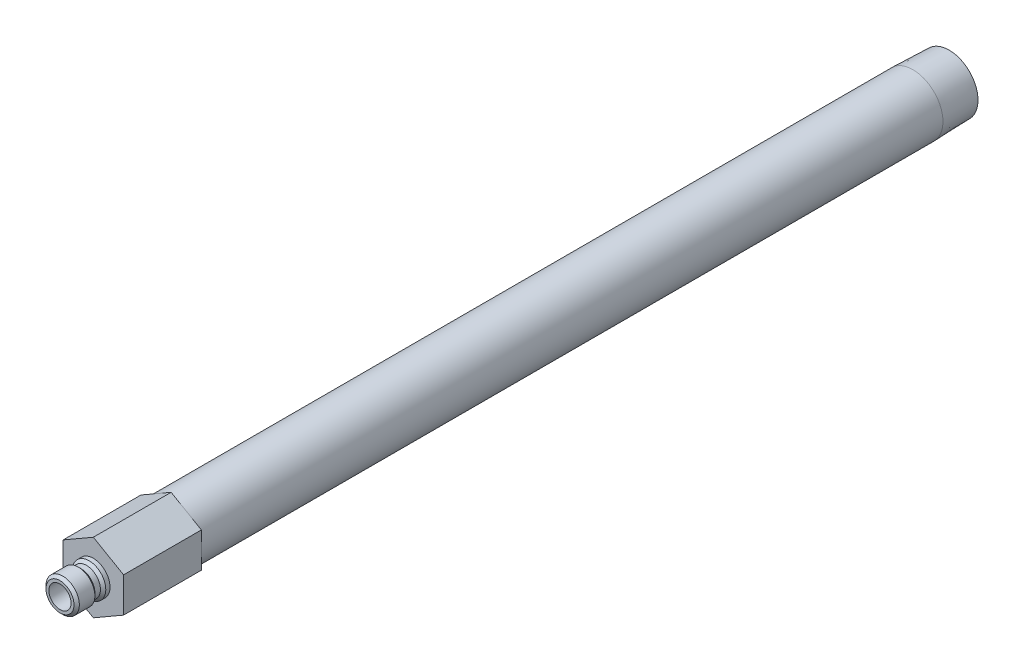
ISO-10303-21;
HEADER;
FILE_DESCRIPTION(('STEP AP214'),'2;1');
FILE_NAME('part.step','',(''),(''),'','','');
FILE_SCHEMA(('AUTOMOTIVE_DESIGN { 1 0 10303 214 1 1 1 1 }'));
ENDSEC;
DATA;
#1=APPLICATION_CONTEXT('core data for automotive mechanical design processes');
#2=APPLICATION_PROTOCOL_DEFINITION('international standard','automotive_design',2000,#1);
#3=PRODUCT_CONTEXT('',#1,'mechanical');
#4=PRODUCT('Part','Part','',(#3));
#5=PRODUCT_RELATED_PRODUCT_CATEGORY('part','',(#4));
#6=PRODUCT_DEFINITION_FORMATION('','',#4);
#7=PRODUCT_DEFINITION_CONTEXT('part definition',#1,'design');
#8=PRODUCT_DEFINITION('design','',#6,#7);
#9=PRODUCT_DEFINITION_SHAPE('','',#8);
#10=(LENGTH_UNIT() NAMED_UNIT(*) SI_UNIT(.MILLI.,.METRE.));
#11=(NAMED_UNIT(*) PLANE_ANGLE_UNIT() SI_UNIT($,.RADIAN.));
#12=(NAMED_UNIT(*) SI_UNIT($,.STERADIAN.) SOLID_ANGLE_UNIT());
#13=UNCERTAINTY_MEASURE_WITH_UNIT(LENGTH_MEASURE(1.E-05),#10,'distance_accuracy_value','');
#14=(GEOMETRIC_REPRESENTATION_CONTEXT(3) GLOBAL_UNCERTAINTY_ASSIGNED_CONTEXT((#13)) GLOBAL_UNIT_ASSIGNED_CONTEXT((#10,
#11,#12)) REPRESENTATION_CONTEXT('',''));
#15=CARTESIAN_POINT('',(0.,0.,0.));
#16=DIRECTION('',(0.,0.,1.));
#17=DIRECTION('',(1.,0.,0.));
#18=AXIS2_PLACEMENT_3D('',#15,#16,#17);
#19=CARTESIAN_POINT('',(0.,0.,0.));
#20=DIRECTION('',(0.,0.,-1.));
#21=DIRECTION('',(0.,1.,0.));
#22=AXIS2_PLACEMENT_3D('',#19,#20,#21);
#23=CYLINDRICAL_SURFACE('',#22,8.57249999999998);
#24=CARTESIAN_POINT('',(0.,0.,-234.1372));
#25=DIRECTION('',(0.,0.,-1.));
#26=DIRECTION('',(0.,1.,0.));
#27=AXIS2_PLACEMENT_3D('',#24,#25,#26);
#28=CIRCLE('',#27,8.57249999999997);
#29=CARTESIAN_POINT('',(0.,8.5725,-234.1372));
#30=VERTEX_POINT('',#29);
#31=EDGE_CURVE('E168',#30,#30,#28,.T.);
#32=ORIENTED_EDGE('',*,*,#31,.F.);
#33=EDGE_LOOP('',(#32));
#34=FACE_BOUND('',#33,.T.);
#35=CARTESIAN_POINT('',(0.,0.,-22.225));
#36=DIRECTION('',(0.,0.,1.));
#37=DIRECTION('',(1.,0.,0.));
#38=AXIS2_PLACEMENT_3D('',#35,#36,#37);
#39=CIRCLE('',#38,8.57249999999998);
#40=CARTESIAN_POINT('',(8.57249999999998,0.,-22.225));
#41=VERTEX_POINT('',#40);
#42=EDGE_CURVE('E37',#41,#41,#39,.F.);
#43=ORIENTED_EDGE('',*,*,#42,.T.);
#44=EDGE_LOOP('',(#43));
#45=FACE_BOUND('',#44,.T.);
#46=ADVANCED_FACE('F33',(#34,#45),#23,.T.);
#47=CARTESIAN_POINT('',(0.,0.,0.));
#48=DIRECTION('',(0.,0.,-1.));
#49=DIRECTION('',(0.,1.,0.));
#50=AXIS2_PLACEMENT_3D('',#47,#48,#49);
#51=CYLINDRICAL_SURFACE('',#50,3.175);
#52=CARTESIAN_POINT('',(0.,0.,9.525));
#53=DIRECTION('',(0.,0.,-1.));
#54=DIRECTION('',(0.,1.,0.));
#55=AXIS2_PLACEMENT_3D('',#52,#53,#54);
#56=CIRCLE('',#55,3.175);
#57=CARTESIAN_POINT('',(0.,3.175,9.525));
#58=VERTEX_POINT('',#57);
#59=EDGE_CURVE('E144',#58,#58,#56,.T.);
#60=ORIENTED_EDGE('',*,*,#59,.F.);
#61=EDGE_LOOP('',(#60));
#62=FACE_BOUND('',#61,.T.);
#63=CARTESIAN_POINT('',(0.,0.,-22.225));
#64=DIRECTION('',(0.,0.,-1.));
#65=DIRECTION('',(0.,1.,0.));
#66=AXIS2_PLACEMENT_3D('',#63,#64,#65);
#67=CIRCLE('',#66,3.17499999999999);
#68=CARTESIAN_POINT('',(0.,3.175,-22.225));
#69=VERTEX_POINT('',#68);
#70=EDGE_CURVE('E11',#69,#69,#67,.T.);
#71=ORIENTED_EDGE('',*,*,#70,.T.);
#72=EDGE_LOOP('',(#71));
#73=FACE_BOUND('',#72,.T.);
#74=ADVANCED_FACE('F35',(#62,#73),#51,.F.);
#75=CARTESIAN_POINT('',(0.,3.175,-22.225));
#76=DIRECTION('',(0.,0.,-1.));
#77=DIRECTION('',(0.,1.,0.));
#78=AXIS2_PLACEMENT_3D('',#75,#76,#77);
#79=PLANE('',#78);
#80=CARTESIAN_POINT('',(0.,0.,-22.225));
#81=DIRECTION('',(0.,0.,-1.));
#82=DIRECTION('',(0.,1.,0.));
#83=AXIS2_PLACEMENT_3D('',#80,#81,#82);
#84=CIRCLE('',#83,6.2611);
#85=CARTESIAN_POINT('',(0.,6.2611,-22.225));
#86=VERTEX_POINT('',#85);
#87=EDGE_CURVE('E43',#86,#86,#84,.T.);
#88=ORIENTED_EDGE('',*,*,#87,.T.);
#89=EDGE_LOOP('',(#88));
#90=FACE_BOUND('',#89,.T.);
#91=ORIENTED_EDGE('',*,*,#70,.F.);
#92=EDGE_LOOP('',(#91));
#93=FACE_BOUND('',#92,.T.);
#94=ADVANCED_FACE('F180',(#90,#93),#79,.T.);
#95=CARTESIAN_POINT('',(0.,0.,0.));
#96=DIRECTION('',(0.,0.,-1.));
#97=DIRECTION('',(0.,1.,0.));
#98=AXIS2_PLACEMENT_3D('',#95,#96,#97);
#99=CYLINDRICAL_SURFACE('',#98,6.26109999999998);
#100=CARTESIAN_POINT('',(0.,0.,-244.475));
#101=DIRECTION('',(0.,0.,-1.));
#102=DIRECTION('',(0.,1.,0.));
#103=AXIS2_PLACEMENT_3D('',#100,#101,#102);
#104=CIRCLE('',#103,6.26109999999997);
#105=CARTESIAN_POINT('',(0.,6.2611,-244.475));
#106=VERTEX_POINT('',#105);
#107=EDGE_CURVE('E174',#106,#106,#104,.T.);
#108=ORIENTED_EDGE('',*,*,#107,.T.);
#109=EDGE_LOOP('',(#108));
#110=FACE_BOUND('',#109,.T.);
#111=ORIENTED_EDGE('',*,*,#87,.F.);
#112=EDGE_LOOP('',(#111));
#113=FACE_BOUND('',#112,.T.);
#114=ADVANCED_FACE('F183',(#110,#113),#99,.F.);
#115=CARTESIAN_POINT('',(0.,8.24944566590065,-244.475));
#116=DIRECTION('',(0.,0.,-1.));
#117=DIRECTION('',(0.,1.,0.));
#118=AXIS2_PLACEMENT_3D('',#115,#116,#117);
#119=PLANE('',#118);
#120=CARTESIAN_POINT('',(0.,0.,-244.475));
#121=DIRECTION('',(0.,0.,-1.));
#122=DIRECTION('',(0.,1.,0.));
#123=AXIS2_PLACEMENT_3D('',#120,#121,#122);
#124=CIRCLE('',#123,8.24944566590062);
#125=CARTESIAN_POINT('',(0.,8.24944566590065,-244.475));
#126=VERTEX_POINT('',#125);
#127=EDGE_CURVE('E171',#126,#126,#124,.T.);
#128=ORIENTED_EDGE('',*,*,#127,.T.);
#129=EDGE_LOOP('',(#128));
#130=FACE_BOUND('',#129,.T.);
#131=ORIENTED_EDGE('',*,*,#107,.F.);
#132=EDGE_LOOP('',(#131));
#133=FACE_BOUND('',#132,.T.);
#134=ADVANCED_FACE('F185',(#130,#133),#119,.T.);
#135=CARTESIAN_POINT('',(0.,0.,-244.475));
#136=DIRECTION('',(0.,0.,1.));
#137=DIRECTION('',(0.,-1.,0.));
#138=AXIS2_PLACEMENT_3D('',#135,#136,#137);
#139=CONICAL_SURFACE('',#138,8.24944566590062,0.0312396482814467);
#140=ORIENTED_EDGE('',*,*,#31,.T.);
#141=EDGE_LOOP('',(#140));
#142=FACE_BOUND('',#141,.T.);
#143=ORIENTED_EDGE('',*,*,#127,.F.);
#144=EDGE_LOOP('',(#143));
#145=FACE_BOUND('',#144,.T.);
#146=ADVANCED_FACE('F192',(#142,#145),#139,.T.);
#147=CARTESIAN_POINT('',(0.,4.7625,0.));
#148=DIRECTION('',(0.,0.,1.));
#149=DIRECTION('',(0.,-1.,0.));
#150=AXIS2_PLACEMENT_3D('',#147,#148,#149);
#151=PLANE('',#150);
#152=CARTESIAN_POINT('',(0.,0.,0.));
#153=DIRECTION('',(0.,0.,-1.));
#154=DIRECTION('',(0.,1.,0.));
#155=AXIS2_PLACEMENT_3D('',#152,#153,#154);
#156=CIRCLE('',#155,4.7625);
#157=CARTESIAN_POINT('',(0.,4.7625,0.));
#158=VERTEX_POINT('',#157);
#159=EDGE_CURVE('E165',#158,#158,#156,.T.);
#160=ORIENTED_EDGE('',*,*,#159,.T.);
#161=EDGE_LOOP('',(#160));
#162=FACE_BOUND('',#161,.T.);
#163=DIRECTION('',(-0.866025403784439,-0.5,0.));
#164=VECTOR('',#163,1.);
#165=CARTESIAN_POINT('',(0.,9.97199384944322,0.));
#166=LINE('',#165,#164);
#167=CARTESIAN_POINT('',(0.,9.97199384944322,0.));
#168=VERTEX_POINT('',#167);
#169=CARTESIAN_POINT('',(-8.636,4.98599692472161,0.));
#170=VERTEX_POINT('',#169);
#171=EDGE_CURVE('E122',#168,#170,#166,.T.);
#172=ORIENTED_EDGE('',*,*,#171,.T.);
#173=DIRECTION('',(0.,-1.,0.));
#174=VECTOR('',#173,1.);
#175=CARTESIAN_POINT('',(-8.636,4.98599692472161,0.));
#176=LINE('',#175,#174);
#177=CARTESIAN_POINT('',(-8.636,-4.98599692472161,0.));
#178=VERTEX_POINT('',#177);
#179=EDGE_CURVE('E125',#170,#178,#176,.T.);
#180=ORIENTED_EDGE('',*,*,#179,.T.);
#181=DIRECTION('',(0.866025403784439,-0.5,0.));
#182=VECTOR('',#181,1.);
#183=CARTESIAN_POINT('',(-8.636,-4.98599692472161,0.));
#184=LINE('',#183,#182);
#185=CARTESIAN_POINT('',(0.,-9.97199384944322,0.));
#186=VERTEX_POINT('',#185);
#187=EDGE_CURVE('E128',#178,#186,#184,.T.);
#188=ORIENTED_EDGE('',*,*,#187,.T.);
#189=DIRECTION('',(0.866025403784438,0.5,0.));
#190=VECTOR('',#189,1.);
#191=CARTESIAN_POINT('',(0.,-9.97199384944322,0.));
#192=LINE('',#191,#190);
#193=CARTESIAN_POINT('',(8.636,-4.98599692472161,0.));
#194=VERTEX_POINT('',#193);
#195=EDGE_CURVE('E131',#186,#194,#192,.T.);
#196=ORIENTED_EDGE('',*,*,#195,.T.);
#197=DIRECTION('',(0.,1.,0.));
#198=VECTOR('',#197,1.);
#199=CARTESIAN_POINT('',(8.636,-4.98599692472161,0.));
#200=LINE('',#199,#198);
#201=CARTESIAN_POINT('',(8.636,4.98599692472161,0.));
#202=VERTEX_POINT('',#201);
#203=EDGE_CURVE('E99',#194,#202,#200,.T.);
#204=ORIENTED_EDGE('',*,*,#203,.T.);
#205=DIRECTION('',(-0.866025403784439,0.5,0.));
#206=VECTOR('',#205,1.);
#207=CARTESIAN_POINT('',(8.636,4.98599692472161,0.));
#208=LINE('',#207,#206);
#209=EDGE_CURVE('E134',#202,#168,#208,.T.);
#210=ORIENTED_EDGE('',*,*,#209,.T.);
#211=EDGE_LOOP('',(#172,#180,#188,#196,#204,#210));
#212=FACE_BOUND('',#211,.T.);
#213=ADVANCED_FACE('F206',(#162,#212),#151,.T.);
#214=CARTESIAN_POINT('',(0.,0.,0.));
#215=DIRECTION('',(0.,0.,-1.));
#216=DIRECTION('',(0.,1.,0.));
#217=AXIS2_PLACEMENT_3D('',#214,#215,#216);
#218=CYLINDRICAL_SURFACE('',#217,4.7625);
#219=CARTESIAN_POINT('',(0.,0.,1.2065));
#220=DIRECTION('',(0.,0.,-1.));
#221=DIRECTION('',(0.,1.,0.));
#222=AXIS2_PLACEMENT_3D('',#219,#220,#221);
#223=CIRCLE('',#222,4.7625);
#224=CARTESIAN_POINT('',(0.,4.7625,1.2065));
#225=VERTEX_POINT('',#224);
#226=EDGE_CURVE('E162',#225,#225,#223,.T.);
#227=ORIENTED_EDGE('',*,*,#226,.T.);
#228=EDGE_LOOP('',(#227));
#229=FACE_BOUND('',#228,.T.);
#230=ORIENTED_EDGE('',*,*,#159,.F.);
#231=EDGE_LOOP('',(#230));
#232=FACE_BOUND('',#231,.T.);
#233=ADVANCED_FACE('F213',(#229,#232),#218,.T.);
#234=CARTESIAN_POINT('',(0.,0.,1.2065));
#235=DIRECTION('',(0.,0.,-1.));
#236=DIRECTION('',(0.,1.,0.));
#237=AXIS2_PLACEMENT_3D('',#234,#235,#236);
#238=CONICAL_SURFACE('',#237,4.7625,0.785398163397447);
#239=CARTESIAN_POINT('',(0.,0.,1.9685));
#240=DIRECTION('',(0.,0.,-1.));
#241=DIRECTION('',(0.,1.,0.));
#242=AXIS2_PLACEMENT_3D('',#239,#240,#241);
#243=CIRCLE('',#242,4.0005);
#244=CARTESIAN_POINT('',(0.,4.0005,1.9685));
#245=VERTEX_POINT('',#244);
#246=EDGE_CURVE('E159',#245,#245,#243,.T.);
#247=ORIENTED_EDGE('',*,*,#246,.T.);
#248=EDGE_LOOP('',(#247));
#249=FACE_BOUND('',#248,.T.);
#250=ORIENTED_EDGE('',*,*,#226,.F.);
#251=EDGE_LOOP('',(#250));
#252=FACE_BOUND('',#251,.T.);
#253=ADVANCED_FACE('F222',(#249,#252),#238,.T.);
#254=CARTESIAN_POINT('',(0.,0.,0.));
#255=DIRECTION('',(0.,0.,-1.));
#256=DIRECTION('',(0.,1.,0.));
#257=AXIS2_PLACEMENT_3D('',#254,#255,#256);
#258=CYLINDRICAL_SURFACE('',#257,4.0005);
#259=CARTESIAN_POINT('',(0.,0.,3.556));
#260=DIRECTION('',(0.,0.,-1.));
#261=DIRECTION('',(0.,1.,0.));
#262=AXIS2_PLACEMENT_3D('',#259,#260,#261);
#263=CIRCLE('',#262,4.0005);
#264=CARTESIAN_POINT('',(0.,4.0005,3.556));
#265=VERTEX_POINT('',#264);
#266=EDGE_CURVE('E156',#265,#265,#263,.T.);
#267=ORIENTED_EDGE('',*,*,#266,.T.);
#268=EDGE_LOOP('',(#267));
#269=FACE_BOUND('',#268,.T.);
#270=ORIENTED_EDGE('',*,*,#246,.F.);
#271=EDGE_LOOP('',(#270));
#272=FACE_BOUND('',#271,.T.);
#273=ADVANCED_FACE('F263',(#269,#272),#258,.T.);
#274=CARTESIAN_POINT('',(0.,0.,3.556));
#275=DIRECTION('',(0.,0.,1.));
#276=DIRECTION('',(0.,-1.,0.));
#277=AXIS2_PLACEMENT_3D('',#274,#275,#276);
#278=CONICAL_SURFACE('',#277,4.0005,0.785398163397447);
#279=CARTESIAN_POINT('',(0.,0.,4.318));
#280=DIRECTION('',(0.,0.,-1.));
#281=DIRECTION('',(0.,1.,0.));
#282=AXIS2_PLACEMENT_3D('',#279,#280,#281);
#283=CIRCLE('',#282,4.7625);
#284=CARTESIAN_POINT('',(0.,4.7625,4.318));
#285=VERTEX_POINT('',#284);
#286=EDGE_CURVE('E153',#285,#285,#283,.T.);
#287=ORIENTED_EDGE('',*,*,#286,.T.);
#288=EDGE_LOOP('',(#287));
#289=FACE_BOUND('',#288,.T.);
#290=ORIENTED_EDGE('',*,*,#266,.F.);
#291=EDGE_LOOP('',(#290));
#292=FACE_BOUND('',#291,.T.);
#293=ADVANCED_FACE('F259',(#289,#292),#278,.T.);
#294=CARTESIAN_POINT('',(0.,0.,0.));
#295=DIRECTION('',(0.,0.,-1.));
#296=DIRECTION('',(0.,1.,0.));
#297=AXIS2_PLACEMENT_3D('',#294,#295,#296);
#298=CYLINDRICAL_SURFACE('',#297,4.7625);
#299=CARTESIAN_POINT('',(0.,0.,8.763));
#300=DIRECTION('',(0.,0.,-1.));
#301=DIRECTION('',(0.,1.,0.));
#302=AXIS2_PLACEMENT_3D('',#299,#300,#301);
#303=CIRCLE('',#302,4.7625);
#304=CARTESIAN_POINT('',(0.,4.7625,8.763));
#305=VERTEX_POINT('',#304);
#306=EDGE_CURVE('E150',#305,#305,#303,.T.);
#307=ORIENTED_EDGE('',*,*,#306,.T.);
#308=EDGE_LOOP('',(#307));
#309=FACE_BOUND('',#308,.T.);
#310=ORIENTED_EDGE('',*,*,#286,.F.);
#311=EDGE_LOOP('',(#310));
#312=FACE_BOUND('',#311,.T.);
#313=ADVANCED_FACE('F255',(#309,#312),#298,.T.);
#314=CARTESIAN_POINT('',(0.,0.,8.763));
#315=DIRECTION('',(0.,0.,-1.));
#316=DIRECTION('',(0.,1.,0.));
#317=AXIS2_PLACEMENT_3D('',#314,#315,#316);
#318=CONICAL_SURFACE('',#317,4.7625,0.785398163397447);
#319=CARTESIAN_POINT('',(0.,0.,9.525));
#320=DIRECTION('',(0.,0.,-1.));
#321=DIRECTION('',(0.,1.,0.));
#322=AXIS2_PLACEMENT_3D('',#319,#320,#321);
#323=CIRCLE('',#322,4.0005);
#324=CARTESIAN_POINT('',(0.,4.0005,9.525));
#325=VERTEX_POINT('',#324);
#326=EDGE_CURVE('E147',#325,#325,#323,.T.);
#327=ORIENTED_EDGE('',*,*,#326,.T.);
#328=EDGE_LOOP('',(#327));
#329=FACE_BOUND('',#328,.T.);
#330=ORIENTED_EDGE('',*,*,#306,.F.);
#331=EDGE_LOOP('',(#330));
#332=FACE_BOUND('',#331,.T.);
#333=ADVANCED_FACE('F251',(#329,#332),#318,.T.);
#334=CARTESIAN_POINT('',(0.,3.175,9.525));
#335=DIRECTION('',(0.,0.,1.));
#336=DIRECTION('',(0.,-1.,0.));
#337=AXIS2_PLACEMENT_3D('',#334,#335,#336);
#338=PLANE('',#337);
#339=ORIENTED_EDGE('',*,*,#59,.T.);
#340=EDGE_LOOP('',(#339));
#341=FACE_BOUND('',#340,.T.);
#342=ORIENTED_EDGE('',*,*,#326,.F.);
#343=EDGE_LOOP('',(#342));
#344=FACE_BOUND('',#343,.T.);
#345=ADVANCED_FACE('F239',(#341,#344),#338,.T.);
#346=CARTESIAN_POINT('',(0.,9.97199384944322,-22.225));
#347=DIRECTION('',(-0.5,0.866025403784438,0.));
#348=DIRECTION('',(-0.866025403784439,-0.5,0.));
#349=AXIS2_PLACEMENT_3D('',#346,#347,#348);
#350=PLANE('',#349);
#351=ORIENTED_EDGE('',*,*,#171,.F.);
#352=DIRECTION('',(0.,0.,1.));
#353=VECTOR('',#352,1.);
#354=CARTESIAN_POINT('',(0.,9.97199384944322,-22.225));
#355=LINE('',#354,#353);
#356=CARTESIAN_POINT('',(0.,9.97199384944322,-22.225));
#357=VERTEX_POINT('',#356);
#358=EDGE_CURVE('E51',#357,#168,#355,.T.);
#359=ORIENTED_EDGE('',*,*,#358,.F.);
#360=DIRECTION('',(-0.866025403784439,-0.5,0.));
#361=VECTOR('',#360,1.);
#362=CARTESIAN_POINT('',(0.,9.97199384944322,-22.225));
#363=LINE('',#362,#361);
#364=CARTESIAN_POINT('',(-8.636,4.98599692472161,-22.225));
#365=VERTEX_POINT('',#364);
#366=EDGE_CURVE('E137',#357,#365,#363,.T.);
#367=ORIENTED_EDGE('',*,*,#366,.T.);
#368=DIRECTION('',(0.,0.,1.));
#369=VECTOR('',#368,1.);
#370=CARTESIAN_POINT('',(-8.636,4.98599692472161,-22.225));
#371=LINE('',#370,#369);
#372=EDGE_CURVE('E86',#365,#170,#371,.T.);
#373=ORIENTED_EDGE('',*,*,#372,.T.);
#374=EDGE_LOOP('',(#351,#359,#367,#373));
#375=FACE_BOUND('',#374,.T.);
#376=ADVANCED_FACE('F226',(#375),#350,.T.);
#377=CARTESIAN_POINT('',(8.636,4.98599692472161,-22.225));
#378=DIRECTION('',(0.5,0.866025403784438,0.));
#379=DIRECTION('',(-0.866025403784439,0.5,0.));
#380=AXIS2_PLACEMENT_3D('',#377,#378,#379);
#381=PLANE('',#380);
#382=ORIENTED_EDGE('',*,*,#209,.F.);
#383=DIRECTION('',(0.,0.,1.));
#384=VECTOR('',#383,1.);
#385=CARTESIAN_POINT('',(8.636,4.98599692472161,-22.225));
#386=LINE('',#385,#384);
#387=CARTESIAN_POINT('',(8.636,4.98599692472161,-22.225));
#388=VERTEX_POINT('',#387);
#389=EDGE_CURVE('E74',#388,#202,#386,.T.);
#390=ORIENTED_EDGE('',*,*,#389,.F.);
#391=DIRECTION('',(-0.866025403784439,0.5,0.));
#392=VECTOR('',#391,1.);
#393=CARTESIAN_POINT('',(8.636,4.98599692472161,-22.225));
#394=LINE('',#393,#392);
#395=EDGE_CURVE('E112',#388,#357,#394,.T.);
#396=ORIENTED_EDGE('',*,*,#395,.T.);
#397=ORIENTED_EDGE('',*,*,#358,.T.);
#398=EDGE_LOOP('',(#382,#390,#396,#397));
#399=FACE_BOUND('',#398,.T.);
#400=ADVANCED_FACE('F231',(#399),#381,.T.);
#401=CARTESIAN_POINT('',(8.636,-4.98599692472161,-22.225));
#402=DIRECTION('',(1.,0.,0.));
#403=DIRECTION('',(0.,1.,0.));
#404=AXIS2_PLACEMENT_3D('',#401,#402,#403);
#405=PLANE('',#404);
#406=ORIENTED_EDGE('',*,*,#203,.F.);
#407=DIRECTION('',(0.,0.,1.));
#408=VECTOR('',#407,1.);
#409=CARTESIAN_POINT('',(8.636,-4.98599692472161,-22.225));
#410=LINE('',#409,#408);
#411=CARTESIAN_POINT('',(8.636,-4.98599692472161,-22.225));
#412=VERTEX_POINT('',#411);
#413=EDGE_CURVE('E94',#412,#194,#410,.T.);
#414=ORIENTED_EDGE('',*,*,#413,.F.);
#415=DIRECTION('',(0.,1.,0.));
#416=VECTOR('',#415,1.);
#417=CARTESIAN_POINT('',(8.636,-4.98599692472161,-22.225));
#418=LINE('',#417,#416);
#419=EDGE_CURVE('E97',#412,#388,#418,.T.);
#420=ORIENTED_EDGE('',*,*,#419,.T.);
#421=ORIENTED_EDGE('',*,*,#389,.T.);
#422=EDGE_LOOP('',(#406,#414,#420,#421));
#423=FACE_BOUND('',#422,.T.);
#424=ADVANCED_FACE('F96',(#423),#405,.T.);
#425=CARTESIAN_POINT('',(0.,-9.97199384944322,-22.225));
#426=DIRECTION('',(0.5,-0.866025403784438,0.));
#427=DIRECTION('',(0.866025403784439,0.5,0.));
#428=AXIS2_PLACEMENT_3D('',#425,#426,#427);
#429=PLANE('',#428);
#430=ORIENTED_EDGE('',*,*,#195,.F.);
#431=DIRECTION('',(0.,0.,1.));
#432=VECTOR('',#431,1.);
#433=CARTESIAN_POINT('',(0.,-9.97199384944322,-22.225));
#434=LINE('',#433,#432);
#435=CARTESIAN_POINT('',(0.,-9.97199384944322,-22.225));
#436=VERTEX_POINT('',#435);
#437=EDGE_CURVE('E104',#436,#186,#434,.T.);
#438=ORIENTED_EDGE('',*,*,#437,.F.);
#439=DIRECTION('',(0.866025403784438,0.5,0.));
#440=VECTOR('',#439,1.);
#441=CARTESIAN_POINT('',(0.,-9.97199384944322,-22.225));
#442=LINE('',#441,#440);
#443=EDGE_CURVE('E110',#436,#412,#442,.T.);
#444=ORIENTED_EDGE('',*,*,#443,.T.);
#445=ORIENTED_EDGE('',*,*,#413,.T.);
#446=EDGE_LOOP('',(#430,#438,#444,#445));
#447=FACE_BOUND('',#446,.T.);
#448=ADVANCED_FACE('F114',(#447),#429,.T.);
#449=CARTESIAN_POINT('',(-8.636,-4.98599692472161,-22.225));
#450=DIRECTION('',(-0.5,-0.866025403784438,0.));
#451=DIRECTION('',(0.866025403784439,-0.5,0.));
#452=AXIS2_PLACEMENT_3D('',#449,#450,#451);
#453=PLANE('',#452);
#454=ORIENTED_EDGE('',*,*,#187,.F.);
#455=DIRECTION('',(0.,0.,1.));
#456=VECTOR('',#455,1.);
#457=CARTESIAN_POINT('',(-8.636,-4.98599692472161,-22.225));
#458=LINE('',#457,#456);
#459=CARTESIAN_POINT('',(-8.636,-4.98599692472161,-22.225));
#460=VERTEX_POINT('',#459);
#461=EDGE_CURVE('E141',#460,#178,#458,.T.);
#462=ORIENTED_EDGE('',*,*,#461,.F.);
#463=DIRECTION('',(0.866025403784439,-0.5,0.));
#464=VECTOR('',#463,1.);
#465=CARTESIAN_POINT('',(-8.636,-4.98599692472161,-22.225));
#466=LINE('',#465,#464);
#467=EDGE_CURVE('E115',#460,#436,#466,.T.);
#468=ORIENTED_EDGE('',*,*,#467,.T.);
#469=ORIENTED_EDGE('',*,*,#437,.T.);
#470=EDGE_LOOP('',(#454,#462,#468,#469));
#471=FACE_BOUND('',#470,.T.);
#472=ADVANCED_FACE('F230',(#471),#453,.T.);
#473=CARTESIAN_POINT('',(-8.636,4.98599692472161,-22.225));
#474=DIRECTION('',(-1.,0.,0.));
#475=DIRECTION('',(0.,0.,1.));
#476=AXIS2_PLACEMENT_3D('',#473,#474,#475);
#477=PLANE('',#476);
#478=ORIENTED_EDGE('',*,*,#179,.F.);
#479=ORIENTED_EDGE('',*,*,#372,.F.);
#480=DIRECTION('',(0.,-1.,0.));
#481=VECTOR('',#480,1.);
#482=CARTESIAN_POINT('',(-8.636,4.98599692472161,-22.225));
#483=LINE('',#482,#481);
#484=EDGE_CURVE('E117',#365,#460,#483,.T.);
#485=ORIENTED_EDGE('',*,*,#484,.T.);
#486=ORIENTED_EDGE('',*,*,#461,.T.);
#487=EDGE_LOOP('',(#478,#479,#485,#486));
#488=FACE_BOUND('',#487,.T.);
#489=ADVANCED_FACE('F227',(#488),#477,.T.);
#490=CARTESIAN_POINT('',(-8.636,4.98599692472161,-22.225));
#491=DIRECTION('',(0.,0.,1.));
#492=DIRECTION('',(1.,0.,0.));
#493=AXIS2_PLACEMENT_3D('',#490,#491,#492);
#494=PLANE('',#493);
#495=ORIENTED_EDGE('',*,*,#42,.F.);
#496=EDGE_LOOP('',(#495));
#497=FACE_BOUND('',#496,.T.);
#498=ORIENTED_EDGE('',*,*,#366,.F.);
#499=ORIENTED_EDGE('',*,*,#395,.F.);
#500=ORIENTED_EDGE('',*,*,#419,.F.);
#501=ORIENTED_EDGE('',*,*,#443,.F.);
#502=ORIENTED_EDGE('',*,*,#467,.F.);
#503=ORIENTED_EDGE('',*,*,#484,.F.);
#504=EDGE_LOOP('',(#498,#499,#500,#501,#502,#503));
#505=FACE_BOUND('',#504,.T.);
#506=ADVANCED_FACE('F108',(#497,#505),#494,.F.);
#507=CLOSED_SHELL('',(#46,#74,#94,#114,#134,#146,#213,#233,#253,#273,#293,#313,#333,#345,#376,
#400,#424,#448,#472,#489,#506));
#508=MANIFOLD_SOLID_BREP('B2',#507);
#509=ADVANCED_BREP_SHAPE_REPRESENTATION('',(#18,#508),#14);
#510=SHAPE_DEFINITION_REPRESENTATION(#9,#509);
ENDSEC;
END-ISO-10303-21;
